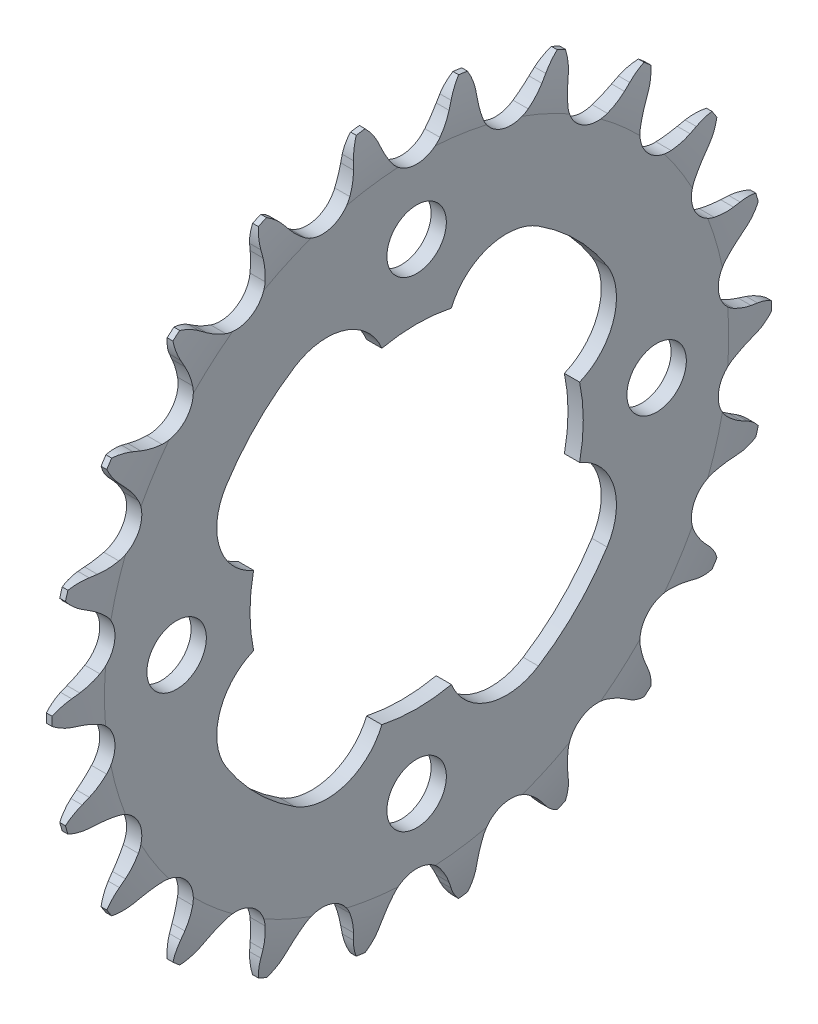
from build123d import *

# Parameters (mm, degrees)
TOOTHCUT_DEPTH    = 68.877629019
TEETHCUTS_COUNT   = 22
TEETHCUTS_ANGLE   = 343.636363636
BORSKE_R          = 3.9624
BORE_DEPTH        = 50.8000508
CIRPATTERN1_COUNT = 4


with BuildPart() as part:
    # BasProSke → Base-Revolve (revolve)
    with BuildSketch(Plane(origin=(0, 0, 0), x_dir=(1, 0, 0), z_dir=(0, 1, 0)), mode=Mode.PRIVATE) as base_revolve_sk:
        with BuildLine():
            Line((0, 0), (0, 41.625220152))
            ThreePointArc((0, 41.625220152), (0.159144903, 44.816055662), (0.635, 47.975220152))
            Line((0.635, 47.975220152), (1.397, 47.975220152))
            ThreePointArc((1.397, 47.975220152), (1.872855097, 44.816055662), (2.032, 41.625220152))
            Line((2.032, 41.625220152), (2.032, 0))
            Line((2.032, 0), (0, 0))
        make_face()
    revolve(base_revolve_sk.sketch.rotate(Axis((-10, 0, 0), (1, 0, 0)), 180), axis=Axis((-10, 0, 0), (1, 0, 0)))

    # TooCutSke → ToothCut (cut, through all)
    with BuildSketch(Plane(origin=(0, 0, 0), x_dir=(0, 0, -1), z_dir=(1, 0, 0))):
        with BuildLine():
            Line((4.485538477, 44.572723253), (4.8616264, 45.490965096))
            ThreePointArc((4.8616264, 45.490965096), (7.212548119, 48.373013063), (10.770603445, 49.456191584))
            ThreePointArc((10.770603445, 49.456191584), (0, 50.615420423), (-10.770603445, 49.456191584))
            ThreePointArc((-10.770603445, 49.456191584), (-7.212548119, 48.373013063), (-4.8616264, 45.490965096))
            Line((-4.8616264, 45.490965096), (-4.485538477, 44.572723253))
            ThreePointArc((-4.485538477, 44.572723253), (-3.882293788, 43.3433232), (-3.119224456, 42.206197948))
            ThreePointArc((-3.119224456, 42.206197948), (0, 40.675650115), (3.119224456, 42.206197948))
            ThreePointArc((3.119224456, 42.206197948), (3.882293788, 43.3433232), (4.485538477, 44.572723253))
        make_face()
    toothcut = extrude(amount=TOOTHCUT_DEPTH, mode=Mode.SUBTRACT)

    # TeethCuts: ToothCut ×22 about axis
    teethcuts_axis = Axis((-10, 0, 0), (1, 0, 0))
    for i in range(1, TEETHCUTS_COUNT):
        add(toothcut.rotate(teethcuts_axis, i * TEETHCUTS_ANGLE / (TEETHCUTS_COUNT - 1)), mode=Mode.SUBTRACT)

    # BorSke → Bore (cut, symmetric)
    with BuildSketch(Plane(origin=(0, 0, 0), x_dir=(0, 0, -1), z_dir=(1, 0, 0))):
        with Locations(Location((0, 32.004, 0), (0, 0, 180))):
            Circle(BORSKE_R)
        with BuildLine():
            ThreePointArc((4.640947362, 21.735046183), (-15.715448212, -15.715448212), (21.735046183, 4.640947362))
            ThreePointArc((21.735046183, 4.640947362), (26.281260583, 9.583258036), (25.401797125, 16.240663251))
            ThreePointArc((25.401797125, 16.240663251), (21.319128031, 21.319128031), (16.240663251, 25.401797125))
            ThreePointArc((16.240663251, 25.401797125), (9.583258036, 26.281260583), (4.640947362, 21.735046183))
        make_face()
    bore = extrude(amount=BORE_DEPTH, both=True, mode=Mode.SUBTRACT)

    # CirPattern1: Bore ×4 about axis
    cirpattern1_axis = Axis((0, 0, 0), (1, 0, 0))
    for i in range(1, CIRPATTERN1_COUNT):
        add(bore.rotate(cirpattern1_axis, i * 360 / CIRPATTERN1_COUNT), mode=Mode.SUBTRACT)


solid = part.part
